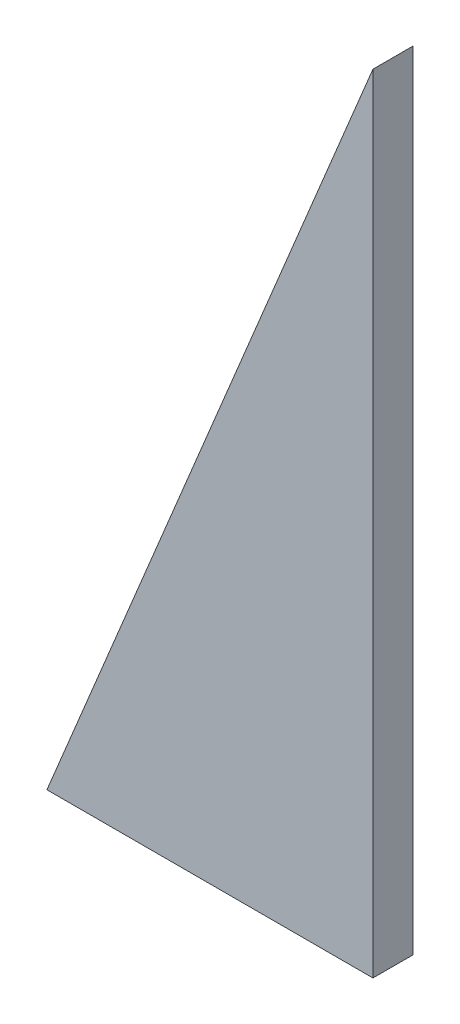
from build123d import *

# Parameters (mm, degrees)
DODANIE_WYCI_GNI_CIE1_DEPTH    = 8
OTW_R_GWINTOWANY_M5X0_81_D     = 4.2
OTW_R_GWINTOWANY_M5X0_81_DEPTH = 14
OTW_R_GWINTOWANY_M5X0_81_TIP   = 1.2618073
OTW_R_GWINTOWANY_M5X0_82_D     = 4.2
OTW_R_GWINTOWANY_M5X0_82_DEPTH = 14
OTW_R_GWINTOWANY_M5X0_82_TIP   = 1.2618073


with BuildPart() as part:
    # Szkic1 → Dodanie-wyci_gni_cie1 (new body)
    with BuildSketch(Plane.XY):
        Polygon((0, 0), (65, 0), (65, 156.923881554), align=None)
    extrude(amount=DODANIE_WYCI_GNI_CIE1_DEPTH)

    # Otw_r gwintowany M5x0.81
    with Locations(Plane(origin=(0, 0, 0), x_dir=(0, 0, 1), z_dir=(-0.9238795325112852, 0.38268343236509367, 0))):
        with Locations((4, 35), (4, 110)):
            Hole(OTW_R_GWINTOWANY_M5X0_81_D / 2, depth=OTW_R_GWINTOWANY_M5X0_81_DEPTH)
            with Locations((0, 0, -(OTW_R_GWINTOWANY_M5X0_81_DEPTH + OTW_R_GWINTOWANY_M5X0_81_TIP / 2))):  # 118° drill point
                Cone(0, OTW_R_GWINTOWANY_M5X0_81_D / 2, OTW_R_GWINTOWANY_M5X0_81_TIP, mode=Mode.SUBTRACT)

    # Otw_r gwintowany M5x0.82
    with Locations(Plane(origin=(0, 0, 0), x_dir=(-1, 0, 0), z_dir=(0, -1, 0))):
        with Locations((-22.5, -4), (-52.5, -4)):
            Hole(OTW_R_GWINTOWANY_M5X0_82_D / 2, depth=OTW_R_GWINTOWANY_M5X0_82_DEPTH)
            with Locations((0, 0, -(OTW_R_GWINTOWANY_M5X0_82_DEPTH + OTW_R_GWINTOWANY_M5X0_82_TIP / 2))):  # 118° drill point
                Cone(0, OTW_R_GWINTOWANY_M5X0_82_D / 2, OTW_R_GWINTOWANY_M5X0_82_TIP, mode=Mode.SUBTRACT)


solid = part.part
